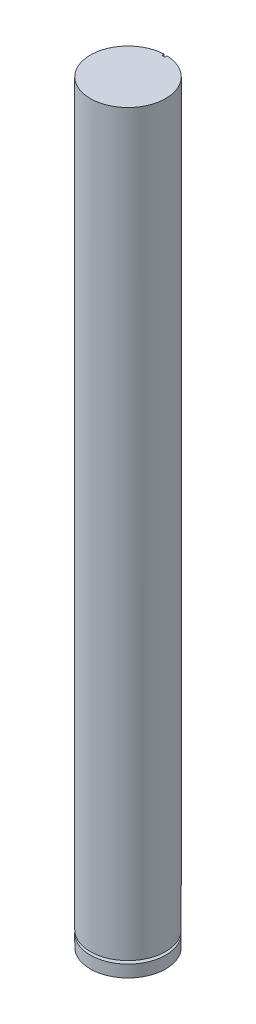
ISO-10303-21;
HEADER;
FILE_DESCRIPTION(('STEP AP214'),'2;1');
FILE_NAME('part.step','',(''),(''),'','','');
FILE_SCHEMA(('AUTOMOTIVE_DESIGN { 1 0 10303 214 1 1 1 1 }'));
ENDSEC;
DATA;
#1=APPLICATION_CONTEXT('core data for automotive mechanical design processes');
#2=APPLICATION_PROTOCOL_DEFINITION('international standard','automotive_design',2000,#1);
#3=PRODUCT_CONTEXT('',#1,'mechanical');
#4=PRODUCT('Part','Part','',(#3));
#5=PRODUCT_RELATED_PRODUCT_CATEGORY('part','',(#4));
#6=PRODUCT_DEFINITION_FORMATION('','',#4);
#7=PRODUCT_DEFINITION_CONTEXT('part definition',#1,'design');
#8=PRODUCT_DEFINITION('design','',#6,#7);
#9=PRODUCT_DEFINITION_SHAPE('','',#8);
#10=(LENGTH_UNIT() NAMED_UNIT(*) SI_UNIT(.MILLI.,.METRE.));
#11=(NAMED_UNIT(*) PLANE_ANGLE_UNIT() SI_UNIT($,.RADIAN.));
#12=(NAMED_UNIT(*) SI_UNIT($,.STERADIAN.) SOLID_ANGLE_UNIT());
#13=UNCERTAINTY_MEASURE_WITH_UNIT(LENGTH_MEASURE(1.E-05),#10,'distance_accuracy_value','');
#14=(GEOMETRIC_REPRESENTATION_CONTEXT(3) GLOBAL_UNCERTAINTY_ASSIGNED_CONTEXT((#13)) GLOBAL_UNIT_ASSIGNED_CONTEXT((#10,
#11,#12)) REPRESENTATION_CONTEXT('',''));
#15=CARTESIAN_POINT('',(0.,0.,0.));
#16=DIRECTION('',(0.,0.,1.));
#17=DIRECTION('',(1.,0.,0.));
#18=AXIS2_PLACEMENT_3D('',#15,#16,#17);
#19=CARTESIAN_POINT('',(0.,50.,0.));
#20=DIRECTION('',(0.,-1.,0.));
#21=DIRECTION('',(0.,0.,-1.));
#22=AXIS2_PLACEMENT_3D('',#19,#20,#21);
#23=CYLINDRICAL_SURFACE('',#22,2.5);
#24=CARTESIAN_POINT('',(0.,0.8,0.));
#25=DIRECTION('',(0.,-1.,0.));
#26=DIRECTION('',(0.,0.,-1.));
#27=AXIS2_PLACEMENT_3D('',#24,#25,#26);
#28=CIRCLE('',#27,2.5);
#29=CARTESIAN_POINT('',(0.,0.8,-2.5));
#30=VERTEX_POINT('',#29);
#31=EDGE_CURVE('E130',#30,#30,#28,.T.);
#32=ORIENTED_EDGE('',*,*,#31,.T.);
#33=EDGE_LOOP('',(#32));
#34=FACE_BOUND('',#33,.T.);
#35=CARTESIAN_POINT('',(0.,0.,0.));
#36=DIRECTION('',(0.,1.,0.));
#37=DIRECTION('',(0.,0.,1.));
#38=AXIS2_PLACEMENT_3D('',#35,#36,#37);
#39=CIRCLE('',#38,2.5);
#40=CARTESIAN_POINT('',(0.,0.,2.5));
#41=VERTEX_POINT('',#40);
#42=EDGE_CURVE('E134',#41,#41,#39,.T.);
#43=ORIENTED_EDGE('',*,*,#42,.T.);
#44=EDGE_LOOP('',(#43));
#45=FACE_BOUND('',#44,.T.);
#46=ADVANCED_FACE('F42',(#34,#45),#23,.T.);
#47=CARTESIAN_POINT('',(0.,0.,0.));
#48=DIRECTION('',(0.,1.,0.));
#49=DIRECTION('',(0.,0.,1.));
#50=AXIS2_PLACEMENT_3D('',#47,#48,#49);
#51=PLANE('',#50);
#52=ORIENTED_EDGE('',*,*,#42,.F.);
#53=EDGE_LOOP('',(#52));
#54=FACE_BOUND('',#53,.T.);
#55=ADVANCED_FACE('F161',(#54),#51,.F.);
#56=CARTESIAN_POINT('',(0.,0.8,-2.5));
#57=DIRECTION('',(0.,-1.,0.));
#58=DIRECTION('',(0.,0.,-1.));
#59=AXIS2_PLACEMENT_3D('',#56,#57,#58);
#60=PLANE('',#59);
#61=ORIENTED_EDGE('',*,*,#31,.F.);
#62=EDGE_LOOP('',(#61));
#63=FACE_BOUND('',#62,.T.);
#64=CARTESIAN_POINT('',(0.,0.799999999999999,0.));
#65=DIRECTION('',(0.,-1.,0.));
#66=DIRECTION('',(0.,0.,-1.));
#67=AXIS2_PLACEMENT_3D('',#64,#65,#66);
#68=CIRCLE('',#67,2.);
#69=CARTESIAN_POINT('',(0.,0.799999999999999,-2.));
#70=VERTEX_POINT('',#69);
#71=EDGE_CURVE('E126',#70,#70,#68,.T.);
#72=ORIENTED_EDGE('',*,*,#71,.T.);
#73=EDGE_LOOP('',(#72));
#74=FACE_BOUND('',#73,.T.);
#75=ADVANCED_FACE('F166',(#63,#74),#60,.F.);
#76=CARTESIAN_POINT('',(0.,0.,0.));
#77=DIRECTION('',(0.,-1.,0.));
#78=DIRECTION('',(0.,0.,-1.));
#79=AXIS2_PLACEMENT_3D('',#76,#77,#78);
#80=CYLINDRICAL_SURFACE('',#79,2.);
#81=ORIENTED_EDGE('',*,*,#71,.F.);
#82=EDGE_LOOP('',(#81));
#83=FACE_BOUND('',#82,.T.);
#84=CARTESIAN_POINT('',(0.,1.,0.));
#85=DIRECTION('',(0.,-1.,0.));
#86=DIRECTION('',(0.,0.,-1.));
#87=AXIS2_PLACEMENT_3D('',#84,#85,#86);
#88=CIRCLE('',#87,2.);
#89=CARTESIAN_POINT('',(0.,1.,-2.));
#90=VERTEX_POINT('',#89);
#91=EDGE_CURVE('E122',#90,#90,#88,.T.);
#92=ORIENTED_EDGE('',*,*,#91,.T.);
#93=EDGE_LOOP('',(#92));
#94=FACE_BOUND('',#93,.T.);
#95=ADVANCED_FACE('F178',(#83,#94),#80,.T.);
#96=CARTESIAN_POINT('',(0.,1.,-2.5));
#97=DIRECTION('',(0.,1.,0.));
#98=DIRECTION('',(0.,0.,1.));
#99=AXIS2_PLACEMENT_3D('',#96,#97,#98);
#100=PLANE('',#99);
#101=ORIENTED_EDGE('',*,*,#91,.F.);
#102=EDGE_LOOP('',(#101));
#103=FACE_BOUND('',#102,.T.);
#104=CARTESIAN_POINT('',(0.,1.,0.));
#105=DIRECTION('',(0.,-1.,0.));
#106=DIRECTION('',(0.,0.,-1.));
#107=AXIS2_PLACEMENT_3D('',#104,#105,#106);
#108=CIRCLE('',#107,2.5);
#109=CARTESIAN_POINT('',(0.,1.,-2.5));
#110=VERTEX_POINT('',#109);
#111=EDGE_CURVE('E117',#110,#110,#108,.T.);
#112=ORIENTED_EDGE('',*,*,#111,.T.);
#113=EDGE_LOOP('',(#112));
#114=FACE_BOUND('',#113,.T.);
#115=ADVANCED_FACE('F173',(#103,#114),#100,.F.);
#116=CARTESIAN_POINT('',(0.,50.,0.));
#117=DIRECTION('',(0.,1.,0.));
#118=DIRECTION('',(0.,0.,1.));
#119=AXIS2_PLACEMENT_3D('',#116,#117,#118);
#120=PLANE('',#119);
#121=DIRECTION('',(0.,0.,1.));
#122=VECTOR('',#121,1.);
#123=CARTESIAN_POINT('',(-0.1,50.,-2.5));
#124=LINE('',#123,#122);
#125=CARTESIAN_POINT('',(-0.1,50.,-2.49799919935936));
#126=VERTEX_POINT('',#125);
#127=CARTESIAN_POINT('',(-0.1,50.,-2.35));
#128=VERTEX_POINT('',#127);
#129=EDGE_CURVE('E94',#126,#128,#124,.T.);
#130=ORIENTED_EDGE('',*,*,#129,.F.);
#131=CARTESIAN_POINT('',(0.,50.,0.));
#132=DIRECTION('',(0.,1.,0.));
#133=DIRECTION('',(0.,0.,1.));
#134=AXIS2_PLACEMENT_3D('',#131,#132,#133);
#135=CIRCLE('',#134,2.5);
#136=CARTESIAN_POINT('',(0.1,50.,-2.49799919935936));
#137=VERTEX_POINT('',#136);
#138=EDGE_CURVE('E135',#126,#137,#135,.T.);
#139=ORIENTED_EDGE('',*,*,#138,.T.);
#140=DIRECTION('',(0.,0.,-1.));
#141=VECTOR('',#140,1.);
#142=CARTESIAN_POINT('',(0.1,50.,-2.5));
#143=LINE('',#142,#141);
#144=CARTESIAN_POINT('',(0.1,50.,-2.35));
#145=VERTEX_POINT('',#144);
#146=EDGE_CURVE('E88',#145,#137,#143,.T.);
#147=ORIENTED_EDGE('',*,*,#146,.F.);
#148=DIRECTION('',(1.,0.,0.));
#149=VECTOR('',#148,1.);
#150=CARTESIAN_POINT('',(-0.1,50.,-2.35));
#151=LINE('',#150,#149);
#152=EDGE_CURVE('E111',#128,#145,#151,.T.);
#153=ORIENTED_EDGE('',*,*,#152,.F.);
#154=EDGE_LOOP('',(#130,#139,#147,#153));
#155=FACE_BOUND('',#154,.T.);
#156=ADVANCED_FACE('F149',(#155),#120,.T.);
#157=ORIENTED_EDGE('',*,*,#138,.F.);
#158=DIRECTION('',(0.,-1.,0.));
#159=VECTOR('',#158,1.);
#160=CARTESIAN_POINT('',(-0.1,50.,-2.49799919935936));
#161=LINE('',#160,#159);
#162=CARTESIAN_POINT('',(-0.1,47.,-2.49799919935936));
#163=VERTEX_POINT('',#162);
#164=EDGE_CURVE('E11',#126,#163,#161,.T.);
#165=ORIENTED_EDGE('',*,*,#164,.T.);
#166=CARTESIAN_POINT('',(0.,47.,0.));
#167=DIRECTION('',(0.,1.,0.));
#168=DIRECTION('',(0.,0.,1.));
#169=AXIS2_PLACEMENT_3D('',#166,#167,#168);
#170=CIRCLE('',#169,2.5);
#171=CARTESIAN_POINT('',(0.1,47.,-2.49799919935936));
#172=VERTEX_POINT('',#171);
#173=EDGE_CURVE('E57',#172,#163,#170,.T.);
#174=ORIENTED_EDGE('',*,*,#173,.F.);
#175=DIRECTION('',(0.,-1.,0.));
#176=VECTOR('',#175,1.);
#177=CARTESIAN_POINT('',(0.1,50.,-2.49799919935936));
#178=LINE('',#177,#176);
#179=EDGE_CURVE('E51',#172,#137,#178,.F.);
#180=ORIENTED_EDGE('',*,*,#179,.T.);
#181=EDGE_LOOP('',(#157,#165,#174,#180));
#182=FACE_BOUND('',#181,.T.);
#183=ORIENTED_EDGE('',*,*,#111,.F.);
#184=EDGE_LOOP('',(#183));
#185=FACE_BOUND('',#184,.T.);
#186=ADVANCED_FACE('F44',(#182,#185),#23,.T.);
#187=CARTESIAN_POINT('',(-0.1,47.,-2.5));
#188=DIRECTION('',(-1.,0.,0.));
#189=DIRECTION('',(0.,0.,1.));
#190=AXIS2_PLACEMENT_3D('',#187,#188,#189);
#191=PLANE('',#190);
#192=ORIENTED_EDGE('',*,*,#129,.T.);
#193=DIRECTION('',(0.,1.,0.));
#194=VECTOR('',#193,1.);
#195=CARTESIAN_POINT('',(-0.1,47.,-2.35));
#196=LINE('',#195,#194);
#197=CARTESIAN_POINT('',(-0.1,47.,-2.35));
#198=VERTEX_POINT('',#197);
#199=EDGE_CURVE('E91',#198,#128,#196,.T.);
#200=ORIENTED_EDGE('',*,*,#199,.F.);
#201=DIRECTION('',(0.,0.,1.));
#202=VECTOR('',#201,1.);
#203=CARTESIAN_POINT('',(-0.1,47.,-2.5));
#204=LINE('',#203,#202);
#205=EDGE_CURVE('E81',#163,#198,#204,.T.);
#206=ORIENTED_EDGE('',*,*,#205,.F.);
#207=ORIENTED_EDGE('',*,*,#164,.F.);
#208=EDGE_LOOP('',(#192,#200,#206,#207));
#209=FACE_BOUND('',#208,.T.);
#210=ADVANCED_FACE('F92',(#209),#191,.F.);
#211=CARTESIAN_POINT('',(0.1,47.,-2.5));
#212=DIRECTION('',(1.,0.,0.));
#213=DIRECTION('',(0.,0.,-1.));
#214=AXIS2_PLACEMENT_3D('',#211,#212,#213);
#215=PLANE('',#214);
#216=DIRECTION('',(0.,0.,-1.));
#217=VECTOR('',#216,1.);
#218=CARTESIAN_POINT('',(0.1,47.,-2.5));
#219=LINE('',#218,#217);
#220=CARTESIAN_POINT('',(0.1,47.,-2.35));
#221=VERTEX_POINT('',#220);
#222=EDGE_CURVE('E100',#221,#172,#219,.T.);
#223=ORIENTED_EDGE('',*,*,#222,.F.);
#224=DIRECTION('',(0.,1.,0.));
#225=VECTOR('',#224,1.);
#226=CARTESIAN_POINT('',(0.1,47.,-2.35));
#227=LINE('',#226,#225);
#228=EDGE_CURVE('E99',#221,#145,#227,.T.);
#229=ORIENTED_EDGE('',*,*,#228,.T.);
#230=ORIENTED_EDGE('',*,*,#146,.T.);
#231=ORIENTED_EDGE('',*,*,#179,.F.);
#232=EDGE_LOOP('',(#223,#229,#230,#231));
#233=FACE_BOUND('',#232,.T.);
#234=ADVANCED_FACE('F150',(#233),#215,.F.);
#235=CARTESIAN_POINT('',(0.,47.,0.));
#236=DIRECTION('',(0.,1.,0.));
#237=DIRECTION('',(0.,0.,1.));
#238=AXIS2_PLACEMENT_3D('',#235,#236,#237);
#239=PLANE('',#238);
#240=ORIENTED_EDGE('',*,*,#222,.T.);
#241=ORIENTED_EDGE('',*,*,#173,.T.);
#242=ORIENTED_EDGE('',*,*,#205,.T.);
#243=DIRECTION('',(1.,0.,0.));
#244=VECTOR('',#243,1.);
#245=CARTESIAN_POINT('',(-0.1,47.,-2.35));
#246=LINE('',#245,#244);
#247=EDGE_CURVE('E85',#198,#221,#246,.T.);
#248=ORIENTED_EDGE('',*,*,#247,.T.);
#249=EDGE_LOOP('',(#240,#241,#242,#248));
#250=FACE_BOUND('',#249,.T.);
#251=ADVANCED_FACE('F83',(#250),#239,.T.);
#252=CARTESIAN_POINT('',(-0.1,47.,-2.35));
#253=DIRECTION('',(0.,0.,1.));
#254=DIRECTION('',(1.,0.,0.));
#255=AXIS2_PLACEMENT_3D('',#252,#253,#254);
#256=PLANE('',#255);
#257=ORIENTED_EDGE('',*,*,#152,.T.);
#258=ORIENTED_EDGE('',*,*,#228,.F.);
#259=ORIENTED_EDGE('',*,*,#247,.F.);
#260=ORIENTED_EDGE('',*,*,#199,.T.);
#261=EDGE_LOOP('',(#257,#258,#259,#260));
#262=FACE_BOUND('',#261,.T.);
#263=ADVANCED_FACE('F102',(#262),#256,.F.);
#264=CLOSED_SHELL('',(#46,#55,#75,#95,#115,#156,#186,#210,#234,#251,#263));
#265=MANIFOLD_SOLID_BREP('B2',#264);
#266=ADVANCED_BREP_SHAPE_REPRESENTATION('',(#18,#265),#14);
#267=SHAPE_DEFINITION_REPRESENTATION(#9,#266);
ENDSEC;
END-ISO-10303-21;
